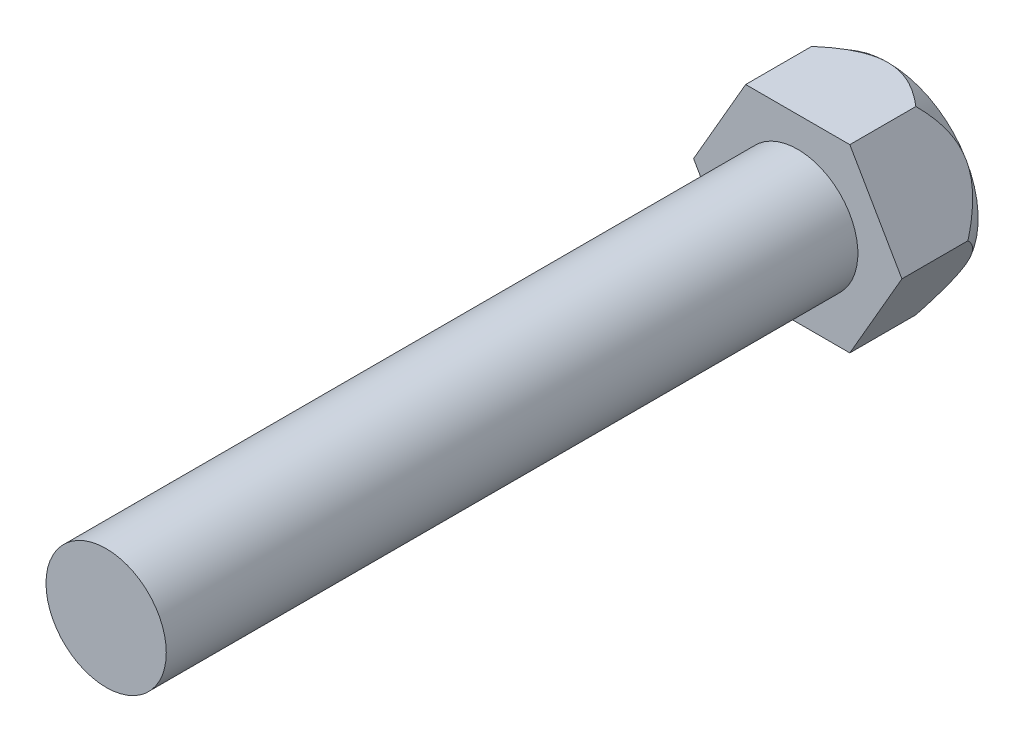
from build123d import *

# Parameters (mm, degrees)
SKETCH1_R           = 10
BOSS_EXTRUDE1_DEPTH = 57.5
BOSS_EXTRUDE2_DEPTH = 15


with BuildPart() as part:
    # Sketch1 → Boss-Extrude1 (new, symmetric)
    with BuildSketch(Plane.XY):
        Circle(SKETCH1_R)
    extrude(amount=BOSS_EXTRUDE1_DEPTH, both=True)

    # Sketch2 → Boss-Extrude2 (add)
    with BuildSketch(Plane(origin=(0, 0, -57.5), x_dir=(-1, 0, 0), z_dir=(0, 0, -1))):
        Polygon((17.320508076, 0), (8.660254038, 15), (-8.660254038, 15), (-17.320508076, 0), (-8.660254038, -15), (8.660254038, -15), align=None)
    extrude(amount=BOSS_EXTRUDE2_DEPTH)

    # Sketch3 → Cut-Revolve1 (revolve, cut)
    with BuildSketch(Plane(origin=(0, 0, 0), x_dir=(0, 0, 1), z_dir=(-0.8660254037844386, 0.5000000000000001, 0)), mode=Mode.PRIVATE) as cut_revolve1_sk:
        Polygon((-72.5, 15), (-72.5, 17.320508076), (-68.480762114, 17.320508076), align=None)
    revolve(cut_revolve1_sk.sketch.rotate(Axis((0, 0, 65.441576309), (0, 0, -1)), 240), axis=Axis((0, 0, 65.441576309), (0, 0, -1)), mode=Mode.SUBTRACT)


solid = part.part
